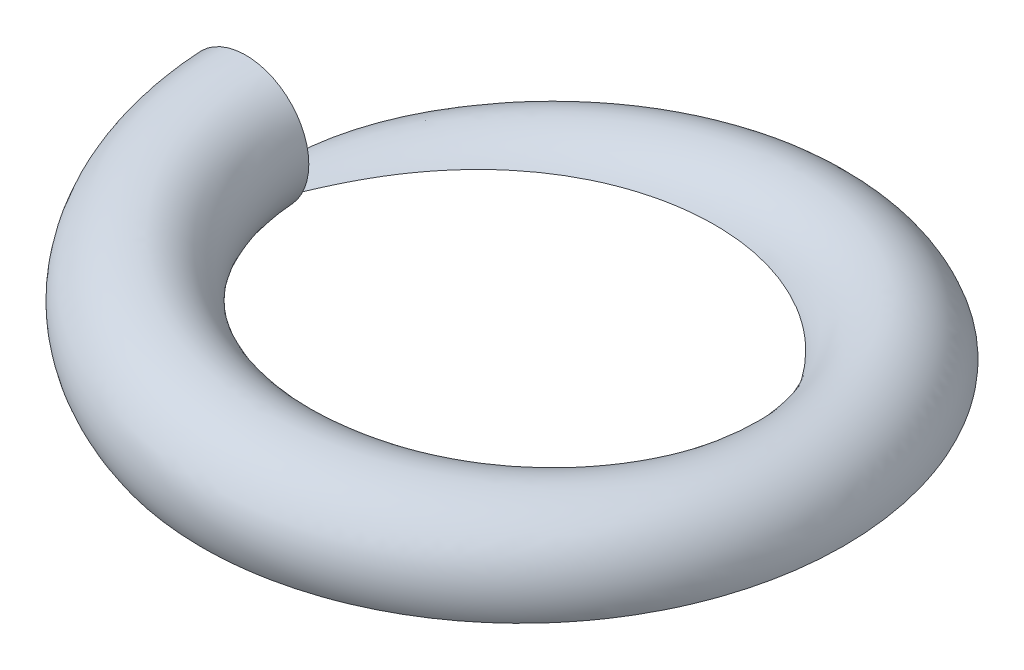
ISO-10303-21;
HEADER;
FILE_DESCRIPTION(('STEP AP214'),'2;1');
FILE_NAME('part.step','',(''),(''),'','','');
FILE_SCHEMA(('AUTOMOTIVE_DESIGN { 1 0 10303 214 1 1 1 1 }'));
ENDSEC;
DATA;
#1=APPLICATION_CONTEXT('core data for automotive mechanical design processes');
#2=APPLICATION_PROTOCOL_DEFINITION('international standard','automotive_design',2000,#1);
#3=PRODUCT_CONTEXT('',#1,'mechanical');
#4=PRODUCT('Part','Part','',(#3));
#5=PRODUCT_RELATED_PRODUCT_CATEGORY('part','',(#4));
#6=PRODUCT_DEFINITION_FORMATION('','',#4);
#7=PRODUCT_DEFINITION_CONTEXT('part definition',#1,'design');
#8=PRODUCT_DEFINITION('design','',#6,#7);
#9=PRODUCT_DEFINITION_SHAPE('','',#8);
#10=(LENGTH_UNIT() NAMED_UNIT(*) SI_UNIT(.MILLI.,.METRE.));
#11=(NAMED_UNIT(*) PLANE_ANGLE_UNIT() SI_UNIT($,.RADIAN.));
#12=(NAMED_UNIT(*) SI_UNIT($,.STERADIAN.) SOLID_ANGLE_UNIT());
#13=UNCERTAINTY_MEASURE_WITH_UNIT(LENGTH_MEASURE(1.E-05),#10,'distance_accuracy_value','');
#14=(GEOMETRIC_REPRESENTATION_CONTEXT(3) GLOBAL_UNCERTAINTY_ASSIGNED_CONTEXT((#13)) GLOBAL_UNIT_ASSIGNED_CONTEXT((#10,
#11,#12)) REPRESENTATION_CONTEXT('',''));
#15=CARTESIAN_POINT('',(0.,0.,0.));
#16=DIRECTION('',(0.,0.,1.));
#17=DIRECTION('',(1.,0.,0.));
#18=AXIS2_PLACEMENT_3D('',#15,#16,#17);
#19=CARTESIAN_POINT('',(-17.,4.,0.));
#20=DIRECTION('',(0.,0.,1.));
#21=DIRECTION('',(1.,0.,0.));
#22=AXIS2_PLACEMENT_3D('',#19,#20,#21);
#23=PLANE('',#22);
#24=CARTESIAN_POINT('',(-17.,4.,0.));
#25=DIRECTION('',(0.,0.,1.));
#26=DIRECTION('',(1.,0.,0.));
#27=AXIS2_PLACEMENT_3D('',#24,#25,#26);
#28=CIRCLE('',#27,4.);
#29=CARTESIAN_POINT('',(-13.,4.,0.));
#30=VERTEX_POINT('',#29);
#31=CARTESIAN_POINT('',(-17.,0.,0.));
#32=VERTEX_POINT('',#31);
#33=EDGE_CURVE('E11',#30,#32,#28,.T.);
#34=ORIENTED_EDGE('',*,*,#33,.F.);
#35=EDGE_CURVE('E44',#32,#30,#28,.T.);
#36=ORIENTED_EDGE('',*,*,#35,.F.);
#37=EDGE_LOOP('',(#34,#36));
#38=FACE_BOUND('',#37,.T.);
#39=ADVANCED_FACE('F33',(#38),#23,.F.);
#40=CARTESIAN_POINT('',(-13.,4.,0.));
#41=CARTESIAN_POINT('',(-13.,3.499375,5.38477631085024));
#42=CARTESIAN_POINT('',(-9.19238815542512,2.99875,9.19238815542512));
#43=CARTESIAN_POINT('',(-5.38477631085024,2.498125,13.));
#44=CARTESIAN_POINT('',(0.,1.9975,13.));
#45=CARTESIAN_POINT('',(5.38477631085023,1.49687500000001,13.));
#46=CARTESIAN_POINT('',(9.19238815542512,0.996250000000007,9.19238815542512));
#47=CARTESIAN_POINT('',(13.,0.495625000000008,5.38477631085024));
#48=CARTESIAN_POINT('',(13.,-0.00499999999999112,0.));
#49=CARTESIAN_POINT('',(13.,-0.50562499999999,-5.38477631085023));
#50=CARTESIAN_POINT('',(9.19238815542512,-1.00624999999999,-9.19238815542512));
#51=CARTESIAN_POINT('',(5.38477631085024,-1.50687499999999,-13.));
#52=CARTESIAN_POINT('',(0.,-2.00749999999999,-13.));
#53=CARTESIAN_POINT('',(-5.38477631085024,-2.50812499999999,-13.));
#54=CARTESIAN_POINT('',(-9.19238815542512,-3.00874999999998,-9.19238815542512));
#55=CARTESIAN_POINT('',(-13.,-3.50937499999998,-5.38477631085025));
#56=CARTESIAN_POINT('',(-13.,-4.00999999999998,0.));
#57=CARTESIAN_POINT('',(-13.,12.,0.));
#58=CARTESIAN_POINT('',(-13.,11.499375,5.38477631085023));
#59=CARTESIAN_POINT('',(-9.19238815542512,10.99875,9.19238815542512));
#60=CARTESIAN_POINT('',(-5.38477631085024,10.498125,13.));
#61=CARTESIAN_POINT('',(0.,9.9975,13.));
#62=CARTESIAN_POINT('',(5.38477631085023,9.49687500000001,13.));
#63=CARTESIAN_POINT('',(9.19238815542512,8.99625000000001,9.19238815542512));
#64=CARTESIAN_POINT('',(13.,8.49562500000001,5.38477631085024));
#65=CARTESIAN_POINT('',(13.,7.99500000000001,0.));
#66=CARTESIAN_POINT('',(13.,7.49437500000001,-5.38477631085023));
#67=CARTESIAN_POINT('',(9.19238815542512,6.99375000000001,-9.19238815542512));
#68=CARTESIAN_POINT('',(5.38477631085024,6.49312500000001,-13.));
#69=CARTESIAN_POINT('',(0.,5.99250000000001,-13.));
#70=CARTESIAN_POINT('',(-5.38477631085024,5.49187500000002,-13.));
#71=CARTESIAN_POINT('',(-9.19238815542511,4.99125000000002,-9.19238815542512));
#72=CARTESIAN_POINT('',(-13.,4.49062500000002,-5.38477631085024));
#73=CARTESIAN_POINT('',(-13.,3.99000000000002,0.));
#74=CARTESIAN_POINT('',(-21.,12.,0.));
#75=CARTESIAN_POINT('',(-21.,11.499375,8.698484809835));
#76=CARTESIAN_POINT('',(-14.8492424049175,10.99875,14.8492424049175));
#77=CARTESIAN_POINT('',(-8.698484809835,10.498125,21.));
#78=CARTESIAN_POINT('',(0.,9.9975,21.));
#79=CARTESIAN_POINT('',(8.698484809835,9.49687500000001,21.));
#80=CARTESIAN_POINT('',(14.8492424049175,8.99625000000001,14.8492424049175));
#81=CARTESIAN_POINT('',(21.,8.49562500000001,8.698484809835));
#82=CARTESIAN_POINT('',(21.,7.99500000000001,0.));
#83=CARTESIAN_POINT('',(21.,7.49437500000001,-8.69848480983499));
#84=CARTESIAN_POINT('',(14.8492424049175,6.99375000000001,-14.8492424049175));
#85=CARTESIAN_POINT('',(8.69848480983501,6.49312500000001,-21.));
#86=CARTESIAN_POINT('',(0.,5.99250000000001,-21.));
#87=CARTESIAN_POINT('',(-8.698484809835,5.49187500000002,-21.));
#88=CARTESIAN_POINT('',(-14.8492424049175,4.99125000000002,-14.8492424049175));
#89=CARTESIAN_POINT('',(-21.,4.49062500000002,-8.69848480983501));
#90=CARTESIAN_POINT('',(-21.,3.99000000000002,0.));
#91=CARTESIAN_POINT('',(-21.,4.,0.));
#92=CARTESIAN_POINT('',(-21.,3.499375,8.698484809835));
#93=CARTESIAN_POINT('',(-14.8492424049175,2.99875,14.8492424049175));
#94=CARTESIAN_POINT('',(-8.698484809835,2.498125,21.));
#95=CARTESIAN_POINT('',(0.,1.99750000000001,21.));
#96=CARTESIAN_POINT('',(8.698484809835,1.49687500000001,21.));
#97=CARTESIAN_POINT('',(14.8492424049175,0.996250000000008,14.8492424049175));
#98=CARTESIAN_POINT('',(21.,0.495625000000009,8.698484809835));
#99=CARTESIAN_POINT('',(21.,-0.00499999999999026,0.));
#100=CARTESIAN_POINT('',(21.,-0.50562499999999,-8.69848480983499));
#101=CARTESIAN_POINT('',(14.8492424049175,-1.00624999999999,-14.8492424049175));
#102=CARTESIAN_POINT('',(8.69848480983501,-1.50687499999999,-21.));
#103=CARTESIAN_POINT('',(0.,-2.00749999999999,-21.));
#104=CARTESIAN_POINT('',(-8.698484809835,-2.50812499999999,-21.));
#105=CARTESIAN_POINT('',(-14.8492424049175,-3.00874999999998,-14.8492424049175));
#106=CARTESIAN_POINT('',(-21.,-3.50937499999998,-8.69848480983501));
#107=CARTESIAN_POINT('',(-21.,-4.00999999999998,0.));
#108=CARTESIAN_POINT('',(-21.,-4.,0.));
#109=CARTESIAN_POINT('',(-21.,-4.500625,8.698484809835));
#110=CARTESIAN_POINT('',(-14.8492424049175,-5.00125,14.8492424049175));
#111=CARTESIAN_POINT('',(-8.698484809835,-5.501875,21.));
#112=CARTESIAN_POINT('',(0.,-6.0025,21.));
#113=CARTESIAN_POINT('',(8.698484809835,-6.503125,21.));
#114=CARTESIAN_POINT('',(14.8492424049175,-7.00374999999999,14.8492424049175));
#115=CARTESIAN_POINT('',(21.,-7.50437499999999,8.698484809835));
#116=CARTESIAN_POINT('',(21.,-8.00499999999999,0.));
#117=CARTESIAN_POINT('',(21.,-8.50562499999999,-8.69848480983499));
#118=CARTESIAN_POINT('',(14.8492424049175,-9.00624999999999,-14.8492424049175));
#119=CARTESIAN_POINT('',(8.69848480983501,-9.50687499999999,-21.));
#120=CARTESIAN_POINT('',(0.,-10.0075,-21.));
#121=CARTESIAN_POINT('',(-8.698484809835,-10.508125,-21.));
#122=CARTESIAN_POINT('',(-14.8492424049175,-11.00875,-14.8492424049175));
#123=CARTESIAN_POINT('',(-21.,-11.509375,-8.69848480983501));
#124=CARTESIAN_POINT('',(-21.,-12.01,0.));
#125=CARTESIAN_POINT('',(-13.,-4.,0.));
#126=CARTESIAN_POINT('',(-13.,-4.500625,5.38477631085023));
#127=CARTESIAN_POINT('',(-9.19238815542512,-5.00125,9.19238815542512));
#128=CARTESIAN_POINT('',(-5.38477631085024,-5.501875,13.));
#129=CARTESIAN_POINT('',(0.,-6.0025,13.));
#130=CARTESIAN_POINT('',(5.38477631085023,-6.503125,13.));
#131=CARTESIAN_POINT('',(9.19238815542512,-7.00374999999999,9.19238815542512));
#132=CARTESIAN_POINT('',(13.,-7.50437499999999,5.38477631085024));
#133=CARTESIAN_POINT('',(13.,-8.00499999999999,0.));
#134=CARTESIAN_POINT('',(13.,-8.50562499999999,-5.38477631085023));
#135=CARTESIAN_POINT('',(9.19238815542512,-9.00624999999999,-9.19238815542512));
#136=CARTESIAN_POINT('',(5.38477631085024,-9.50687499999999,-13.));
#137=CARTESIAN_POINT('',(0.,-10.0075,-13.));
#138=CARTESIAN_POINT('',(-5.38477631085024,-10.508125,-13.));
#139=CARTESIAN_POINT('',(-9.19238815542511,-11.00875,-9.19238815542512));
#140=CARTESIAN_POINT('',(-13.,-11.509375,-5.38477631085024));
#141=CARTESIAN_POINT('',(-13.,-12.01,0.));
#142=CARTESIAN_POINT('',(-13.,4.,0.));
#143=CARTESIAN_POINT('',(-13.,3.499375,5.38477631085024));
#144=CARTESIAN_POINT('',(-9.19238815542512,2.99875,9.19238815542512));
#145=CARTESIAN_POINT('',(-5.38477631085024,2.498125,13.));
#146=CARTESIAN_POINT('',(0.,1.9975,13.));
#147=CARTESIAN_POINT('',(5.38477631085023,1.49687500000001,13.));
#148=CARTESIAN_POINT('',(9.19238815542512,0.996250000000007,9.19238815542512));
#149=CARTESIAN_POINT('',(13.,0.495625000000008,5.38477631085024));
#150=CARTESIAN_POINT('',(13.,-0.00499999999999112,0.));
#151=CARTESIAN_POINT('',(13.,-0.50562499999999,-5.38477631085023));
#152=CARTESIAN_POINT('',(9.19238815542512,-1.00624999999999,-9.19238815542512));
#153=CARTESIAN_POINT('',(5.38477631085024,-1.50687499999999,-13.));
#154=CARTESIAN_POINT('',(0.,-2.00749999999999,-13.));
#155=CARTESIAN_POINT('',(-5.38477631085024,-2.50812499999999,-13.));
#156=CARTESIAN_POINT('',(-9.19238815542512,-3.00874999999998,-9.19238815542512));
#157=CARTESIAN_POINT('',(-13.,-3.50937499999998,-5.38477631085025));
#158=CARTESIAN_POINT('',(-13.,-4.00999999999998,0.));
#159=(BOUNDED_SURFACE() B_SPLINE_SURFACE(3,2,((#40,#41,#42,#43,#44,#45,#46,#47,#48,#49,#50,#51,
#52,#53,#54,#55,#56),(#57,#58,#59,#60,#61,#62,#63,#64,#65,#66,#67,#68,#69,#70,#71,#72,#73),(#74,
#75,#76,#77,#78,#79,#80,#81,#82,#83,#84,#85,#86,#87,#88,#89,#90),(#91,#92,#93,#94,#95,#96,#97,
#98,#99,#100,#101,#102,#103,#104,#105,#106,#107),(#108,#109,#110,#111,#112,#113,#114,#115,#116,
#117,#118,#119,#120,#121,#122,#123,#124),(#125,#126,#127,#128,#129,#130,#131,#132,#133,#134,
#135,#136,#137,#138,#139,#140,#141),(#142,#143,#144,#145,#146,#147,#148,#149,#150,#151,#152,
#153,#154,#155,#156,#157,#158)),.UNSPECIFIED.,.T.,.F.,.F.) B_SPLINE_SURFACE_WITH_KNOTS((4,3,4),
(3,2,2,2,2,2,2,2,3),(0.,0.5,1.),(0.,0.125,0.25,0.375,0.5,0.625,0.75,0.875,1.),
.UNSPECIFIED.) GEOMETRIC_REPRESENTATION_ITEM() RATIONAL_B_SPLINE_SURFACE(((1.,0.923879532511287,
1.,0.923879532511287,1.,0.923879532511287,1.,0.923879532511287,1.,0.923879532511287,1.,
0.923879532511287,1.,0.923879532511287,1.,0.923879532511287,1.),(0.333333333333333,
0.307959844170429,0.333333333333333,0.307959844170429,0.333333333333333,0.307959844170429,
0.333333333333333,0.307959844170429,0.333333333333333,0.307959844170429,0.333333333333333,
0.307959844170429,0.333333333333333,0.307959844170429,0.333333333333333,0.307959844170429,
0.333333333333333),(0.333333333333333,0.307959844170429,0.333333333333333,0.307959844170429,
0.333333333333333,0.307959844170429,0.333333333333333,0.307959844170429,0.333333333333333,
0.307959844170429,0.333333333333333,0.307959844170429,0.333333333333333,0.307959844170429,
0.333333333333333,0.307959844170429,0.333333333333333),(1.,0.923879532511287,1.,
0.923879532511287,1.,0.923879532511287,1.,0.923879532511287,1.,0.923879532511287,1.,
0.923879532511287,1.,0.923879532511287,1.,0.923879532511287,1.),(0.333333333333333,
0.307959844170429,0.333333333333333,0.307959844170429,0.333333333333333,0.307959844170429,
0.333333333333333,0.307959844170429,0.333333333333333,0.307959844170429,0.333333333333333,
0.307959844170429,0.333333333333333,0.307959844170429,0.333333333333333,0.307959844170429,
0.333333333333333),(0.333333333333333,0.307959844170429,0.333333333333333,0.307959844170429,
0.333333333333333,0.307959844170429,0.333333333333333,0.307959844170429,0.333333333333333,
0.307959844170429,0.333333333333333,0.307959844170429,0.333333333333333,0.307959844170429,
0.333333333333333,0.307959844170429,0.333333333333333),(1.,0.923879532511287,1.,
0.923879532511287,1.,0.923879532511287,1.,0.923879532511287,1.,0.923879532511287,1.,
0.923879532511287,1.,0.923879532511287,1.,0.923879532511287,1.))) REPRESENTATION_ITEM('') SURFACE());
#160=CARTESIAN_POINT('',(-17.,0.,0.));
#161=CARTESIAN_POINT('',(-16.9821654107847,0.,-1.0936756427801E-06));
#162=CARTESIAN_POINT('',(-16.964333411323,0.,0.00169738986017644));
#163=CARTESIAN_POINT('',(-16.929235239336,0.,0.00822917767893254));
#164=CARTESIAN_POINT('',(-16.9119704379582,0.,0.0130695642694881));
#165=CARTESIAN_POINT('',(-16.8504324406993,0.,0.0355143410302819));
#166=CARTESIAN_POINT('',(-16.8090736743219,0.,0.0609497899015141));
#167=CARTESIAN_POINT('',(-16.7490549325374,0.,0.107908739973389));
#168=CARTESIAN_POINT('',(-16.7279790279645,0.,0.126855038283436));
#169=CARTESIAN_POINT('',(-16.6877210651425,0.,0.16668707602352));
#170=CARTESIAN_POINT('',(-16.668537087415,0.,0.187570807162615));
#171=CARTESIAN_POINT('',(-16.6315826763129,0.,0.230761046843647));
#172=CARTESIAN_POINT('',(-16.6138228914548,0.,0.253076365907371));
#173=CARTESIAN_POINT('',(-16.5795232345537,0.,0.298619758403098));
#174=CARTESIAN_POINT('',(-16.5629832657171,0.,0.321847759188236));
#175=CARTESIAN_POINT('',(-16.5239391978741,0.,0.379145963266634));
#176=CARTESIAN_POINT('',(-16.5019473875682,0.,0.41356283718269));
#177=CARTESIAN_POINT('',(-16.4594436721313,0.,0.483303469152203));
#178=CARTESIAN_POINT('',(-16.4389322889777,0.,0.51862754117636));
#179=CARTESIAN_POINT('',(-16.3789942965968,0.,0.625665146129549));
#180=CARTESIAN_POINT('',(-16.3412474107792,0.,0.698314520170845));
#181=CARTESIAN_POINT('',(-16.2683895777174,0.,0.844995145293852));
#182=CARTESIAN_POINT('',(-16.2332817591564,0.,0.919027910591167));
#183=CARTESIAN_POINT('',(-16.1646686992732,0.,1.06801292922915));
#184=CARTESIAN_POINT('',(-16.1311668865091,0.,1.14296675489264));
#185=CARTESIAN_POINT('',(-16.0652349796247,0.,1.29320499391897));
#186=CARTESIAN_POINT('',(-16.0328033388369,0.,1.36848873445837));
#187=CARTESIAN_POINT('',(-15.9685374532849,0.,1.51926894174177));
#188=CARTESIAN_POINT('',(-15.9367029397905,0.,1.59476529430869));
#189=CARTESIAN_POINT('',(-15.8419339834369,0.,1.82058054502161));
#190=CARTESIAN_POINT('',(-15.7793783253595,0.,1.97105762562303));
#191=CARTESIAN_POINT('',(-15.6536733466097,0.,2.27176481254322));
#192=CARTESIAN_POINT('',(-15.5905240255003,0.,2.42199491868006));
#193=CARTESIAN_POINT('',(-15.4626643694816,0.,2.7218603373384));
#194=CARTESIAN_POINT('',(-15.3979534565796,0.,2.87149540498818));
#195=CARTESIAN_POINT('',(-15.2663719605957,0.,3.16981206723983));
#196=CARTESIAN_POINT('',(-15.1995013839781,0.,3.31849366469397));
#197=CARTESIAN_POINT('',(-14.9949746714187,0.,3.76274859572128));
#198=CARTESIAN_POINT('',(-14.8533996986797,0.,4.05654127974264));
#199=CARTESIAN_POINT('',(-14.5581878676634,0.,4.63685001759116));
#200=CARTESIAN_POINT('',(-14.4045908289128,0.,4.92338625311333));
#201=CARTESIAN_POINT('',(-14.083845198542,0.,5.48893966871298));
#202=CARTESIAN_POINT('',(-13.9166918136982,0.,5.7679541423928));
#203=CARTESIAN_POINT('',(-13.568392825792,0.,6.31710038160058));
#204=CARTESIAN_POINT('',(-13.3872468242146,0.,6.58723189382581));
#205=CARTESIAN_POINT('',(-12.91231293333,0.,7.25609637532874));
#206=CARTESIAN_POINT('',(-12.6091299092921,0.,7.64826346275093));
#207=CARTESIAN_POINT('',(-12.1301696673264,0.,8.21592444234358));
#208=CARTESIAN_POINT('',(-11.9664612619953,0.,8.40173716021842));
#209=CARTESIAN_POINT('',(-11.6311035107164,0.,8.76608144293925));
#210=CARTESIAN_POINT('',(-11.4594541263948,0.,8.94461297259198));
#211=CARTESIAN_POINT('',(-11.1082106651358,0.,9.29412360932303));
#212=CARTESIAN_POINT('',(-10.9286073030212,0.,9.46509339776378));
#213=CARTESIAN_POINT('',(-10.6535904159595,0.,9.71535462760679));
#214=CARTESIAN_POINT('',(-10.5609799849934,0.,9.79774514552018));
#215=CARTESIAN_POINT('',(-10.3739214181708,0.,9.96041829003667));
#216=CARTESIAN_POINT('',(-10.2794732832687,0.,10.0407009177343));
#217=CARTESIAN_POINT('',(-10.1364471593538,0.,10.1594761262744));
#218=CARTESIAN_POINT('',(-10.0885494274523,0.,10.1987904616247));
#219=CARTESIAN_POINT('',(-9.99226295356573,0.,10.2768130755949));
#220=CARTESIAN_POINT('',(-9.94387421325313,0.,10.3155213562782));
#221=CARTESIAN_POINT('',(-9.79799655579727,0.,10.4307438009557));
#222=CARTESIAN_POINT('',(-9.69979401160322,0.,10.5063573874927));
#223=CARTESIAN_POINT('',(-9.50154554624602,0.,10.6551206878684));
#224=CARTESIAN_POINT('',(-9.4014996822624,0.,10.7282704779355));
#225=CARTESIAN_POINT('',(-9.19962512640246,0.,10.8720639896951));
#226=CARTESIAN_POINT('',(-9.09779642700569,0.,10.9427077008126));
#227=CARTESIAN_POINT('',(-8.80117963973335,0.,11.1430736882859));
#228=CARTESIAN_POINT('',(-8.60416973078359,0.,11.2695296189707));
#229=CARTESIAN_POINT('',(-8.20443501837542,0.,11.513045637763));
#230=CARTESIAN_POINT('',(-8.00171014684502,0.,11.6301056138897));
#231=CARTESIAN_POINT('',(-7.59093912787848,0.,11.8545777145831));
#232=CARTESIAN_POINT('',(-7.38289219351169,0.,11.9619884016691));
#233=CARTESIAN_POINT('',(-6.96198719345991,0.,12.1668734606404));
#234=CARTESIAN_POINT('',(-6.74912917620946,0.,12.2643479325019));
#235=CARTESIAN_POINT('',(-6.10406480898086,0.,12.5414783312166));
#236=CARTESIAN_POINT('',(-5.66520180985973,0.,12.7059321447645));
#237=CARTESIAN_POINT('',(-4.77400007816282,0.,12.9924085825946));
#238=CARTESIAN_POINT('',(-4.3216637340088,0.,13.1144386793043));
#239=CARTESIAN_POINT('',(-3.45624979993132,0.,13.3040829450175));
#240=CARTESIAN_POINT('',(-3.04414488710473,0.,13.3761198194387));
#241=CARTESIAN_POINT('',(-2.42259936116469,0.,13.4574807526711));
#242=CARTESIAN_POINT('',(-2.21482865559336,0.,13.4801530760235));
#243=CARTESIAN_POINT('',(-1.7984873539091,0.,13.5165393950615));
#244=CARTESIAN_POINT('',(-1.58991674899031,0.,13.5302532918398));
#245=CARTESIAN_POINT('',(-1.17252957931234,0.,13.5486593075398));
#246=CARTESIAN_POINT('',(-0.963713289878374,0.,13.5533577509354));
#247=CARTESIAN_POINT('',(-0.546064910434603,0.,13.55371311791));
#248=CARTESIAN_POINT('',(-0.337232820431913,0.,13.5493700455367));
#249=CARTESIAN_POINT('',(-0.0242953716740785,0.,13.5360653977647));
#250=CARTESIAN_POINT('',(0.0799639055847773,0.,13.5304989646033));
#251=CARTESIAN_POINT('',(0.288327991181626,0.,13.5169874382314));
#252=CARTESIAN_POINT('',(0.392432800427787,0.,13.509042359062));
#253=CARTESIAN_POINT('',(0.704430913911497,0.,13.4816721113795));
#254=CARTESIAN_POINT('',(0.912024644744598,0.,13.4587112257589));
#255=CARTESIAN_POINT('',(1.31976594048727,0.,13.4042322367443));
#256=CARTESIAN_POINT('',(1.51995058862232,0.,13.3729904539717));
#257=CARTESIAN_POINT('',(1.91874457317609,0.,13.3017513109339));
#258=CARTESIAN_POINT('',(2.11735389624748,0.,13.2617538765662));
#259=CARTESIAN_POINT('',(2.71027079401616,0.,13.1287331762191));
#260=CARTESIAN_POINT('',(3.10173915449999,0.,13.0226718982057));
#261=CARTESIAN_POINT('',(3.87389126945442,0.,12.7766362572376));
#262=CARTESIAN_POINT('',(4.25457285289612,0.,12.6366551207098));
#263=CARTESIAN_POINT('',(5.00218825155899,0.,12.3238496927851));
#264=CARTESIAN_POINT('',(5.36912294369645,0.,12.1510275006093));
#265=CARTESIAN_POINT('',(6.07226091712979,0.,11.7812670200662));
#266=CARTESIAN_POINT('',(6.4091053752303,0.,11.5855466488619));
#267=CARTESIAN_POINT('',(7.06504363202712,0.,11.1663415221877));
#268=CARTESIAN_POINT('',(7.38413736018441,0.,10.9428566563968));
#269=CARTESIAN_POINT('',(8.00219031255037,0.,10.4696812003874));
#270=CARTESIAN_POINT('',(8.30115537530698,0.,10.2199982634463));
#271=CARTESIAN_POINT('',(8.73278741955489,0.,9.82716789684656));
#272=CARTESIAN_POINT('',(8.87387468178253,0.,9.69315995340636));
#273=CARTESIAN_POINT('',(9.15024148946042,0.,9.41926065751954));
#274=CARTESIAN_POINT('',(9.28552099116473,0.,9.27936926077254));
#275=CARTESIAN_POINT('',(9.54907919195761,0.,8.99468476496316));
#276=CARTESIAN_POINT('',(9.67739474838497,0.,8.84992577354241));
#277=CARTESIAN_POINT('',(9.92764293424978,0.,8.55500917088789));
#278=CARTESIAN_POINT('',(10.0495759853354,0.,8.4048519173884));
#279=CARTESIAN_POINT('',(10.2868404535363,0.,8.09942649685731));
#280=CARTESIAN_POINT('',(10.402172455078,0.,7.94415878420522));
#281=CARTESIAN_POINT('',(10.6260599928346,0.,7.62876698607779));
#282=CARTESIAN_POINT('',(10.734613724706,0.,7.4686416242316));
#283=CARTESIAN_POINT('',(11.0497415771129,0.,6.98151295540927));
#284=CARTESIAN_POINT('',(11.2458615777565,0.,6.64765504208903));
#285=CARTESIAN_POINT('',(11.608645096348,0.,5.96435455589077));
#286=CARTESIAN_POINT('',(11.7753082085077,0.,5.61491176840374));
#287=CARTESIAN_POINT('',(12.0746927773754,0.,4.91074074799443));
#288=CARTESIAN_POINT('',(12.208074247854,0.,4.55629326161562));
#289=CARTESIAN_POINT('',(12.4445457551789,0.,3.83744127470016));
#290=CARTESIAN_POINT('',(12.5476363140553,0.,3.47303694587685));
#291=CARTESIAN_POINT('',(12.7227525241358,0.,2.73688432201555));
#292=CARTESIAN_POINT('',(12.7947819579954,0.,2.36513692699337));
#293=CARTESIAN_POINT('',(12.9072267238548,0.,1.61689217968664));
#294=CARTESIAN_POINT('',(12.9476422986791,0.,1.24039486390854));
#295=CARTESIAN_POINT('',(12.9964840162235,0.,0.485304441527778));
#296=CARTESIAN_POINT('',(13.00490815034,0.,0.106711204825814));
#297=CARTESIAN_POINT('',(12.9896490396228,0.,-0.649828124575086));
#298=CARTESIAN_POINT('',(12.9659656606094,0.,-1.02777421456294));
#299=CARTESIAN_POINT('',(12.8867640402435,0.,-1.78036007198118));
#300=CARTESIAN_POINT('',(12.8312418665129,0.,-2.15499942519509));
#301=CARTESIAN_POINT('',(12.6888198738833,0.,-2.89825779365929));
#302=CARTESIAN_POINT('',(12.6019205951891,0.,-3.2668769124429));
#303=CARTESIAN_POINT('',(12.3976893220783,0.,-3.99449796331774));
#304=CARTESIAN_POINT('',(12.2804410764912,0.,-4.35352340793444));
#305=CARTESIAN_POINT('',(12.0162505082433,0.,-5.06047894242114));
#306=CARTESIAN_POINT('',(11.8693080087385,0.,-5.40840896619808));
#307=CARTESIAN_POINT('',(11.5467966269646,0.,-6.09065536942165));
#308=CARTESIAN_POINT('',(11.3712336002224,0.,-6.42497451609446));
#309=CARTESIAN_POINT('',(10.9926949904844,0.,-7.07769269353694));
#310=CARTESIAN_POINT('',(10.789719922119,0.,-7.39609202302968));
#311=CARTESIAN_POINT('',(10.3568308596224,0.,-8.01600123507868));
#312=CARTESIAN_POINT('',(10.1268113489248,0.,-8.31743769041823));
#313=CARTESIAN_POINT('',(9.76336975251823,0.,-8.75414737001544));
#314=CARTESIAN_POINT('',(9.63913819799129,0.,-8.89715894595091));
#315=CARTESIAN_POINT('',(9.38471505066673,0.,-9.17777933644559));
#316=CARTESIAN_POINT('',(9.25452341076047,0.,-9.31538810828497));
#317=CARTESIAN_POINT('',(8.85548555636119,0.,-9.7199927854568));
#318=CARTESIAN_POINT('',(8.57819194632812,0.,-9.9787484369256));
#319=CARTESIAN_POINT('',(8.00319994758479,0.,-10.4724272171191));
#320=CARTESIAN_POINT('',(7.70550118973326,0.,-10.7073499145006));
#321=CARTESIAN_POINT('',(7.08924917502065,0.,-11.1536870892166));
#322=CARTESIAN_POINT('',(6.77054577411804,0.,-11.3648944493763));
#323=CARTESIAN_POINT('',(6.11674451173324,0.,-11.7601654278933));
#324=CARTESIAN_POINT('',(5.78164693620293,0.,-11.9442295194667));
#325=CARTESIAN_POINT('',(5.09748755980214,0.,-12.2839498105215));
#326=CARTESIAN_POINT('',(4.74843057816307,0.,-12.4396157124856));
#327=CARTESIAN_POINT('',(4.03865157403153,0.,-12.7215828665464));
#328=CARTESIAN_POINT('',(3.67792906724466,0.,-12.8478828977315));
#329=CARTESIAN_POINT('',(2.94073137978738,0.,-13.0722440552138));
#330=CARTESIAN_POINT('',(2.56409015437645,0.,-13.1697632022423));
#331=CARTESIAN_POINT('',(1.99409457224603,0.,-13.2920080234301));
#332=CARTESIAN_POINT('',(1.80324124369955,0.,-13.3287526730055));
#333=CARTESIAN_POINT('',(1.42014762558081,0.,-13.3941750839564));
#334=CARTESIAN_POINT('',(1.22790735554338,0.,-13.4228529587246));
#335=CARTESIAN_POINT('',(0.842315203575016,0.,-13.4720867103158));
#336=CARTESIAN_POINT('',(0.648962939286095,0.,-13.4926396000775));
#337=CARTESIAN_POINT('',(0.358423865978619,0.,-13.5173404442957));
#338=CARTESIAN_POINT('',(0.26148934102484,0.,-13.5245527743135));
#339=CARTESIAN_POINT('',(0.0674888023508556,0.,-13.5369175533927));
#340=CARTESIAN_POINT('',(-0.0295772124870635,0.,-13.5420699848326));
#341=CARTESIAN_POINT('',(-0.320915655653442,0.,-13.5545888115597));
#342=CARTESIAN_POINT('',(-0.51532360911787,0.,-13.5590163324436));
#343=CARTESIAN_POINT('',(-0.904142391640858,0.,-13.5600394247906));
#344=CARTESIAN_POINT('',(-1.09855322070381,0.,-13.5566349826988));
#345=CARTESIAN_POINT('',(-1.68555879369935,0.,-13.5345548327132));
#346=CARTESIAN_POINT('',(-2.07777193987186,0.,-13.503833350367));
#347=CARTESIAN_POINT('',(-2.85835934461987,0.,-13.4108767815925));
#348=CARTESIAN_POINT('',(-3.24673388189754,0.,-13.3486440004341));
#349=CARTESIAN_POINT('',(-4.01720918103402,0.,-13.1932509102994));
#350=CARTESIAN_POINT('',(-4.39931065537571,0.,-13.1000941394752));
#351=CARTESIAN_POINT('',(-5.15488844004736,0.,-12.8835946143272));
#352=CARTESIAN_POINT('',(-5.52836404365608,0.,-12.7602493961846));
#353=CARTESIAN_POINT('',(-6.28266367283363,0.,-12.4774278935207));
#354=CARTESIAN_POINT('',(-6.66292802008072,0.,-12.316458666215));
#355=CARTESIAN_POINT('',(-7.40881106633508,0.,-11.9634980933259));
#356=CARTESIAN_POINT('',(-7.77443024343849,0.,-11.7715077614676));
#357=CARTESIAN_POINT('',(-8.30994155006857,0.,-11.4613944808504));
#358=CARTESIAN_POINT('',(-8.48631839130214,0.,-11.3543173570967));
#359=CARTESIAN_POINT('',(-8.83450568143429,0.,-11.1329643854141));
#360=CARTESIAN_POINT('',(-9.0063162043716,0.,-11.0186886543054));
#361=CARTESIAN_POINT('',(-9.34507730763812,0.,-10.7831364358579));
#362=CARTESIAN_POINT('',(-9.51202779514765,0.,-10.6618598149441));
#363=CARTESIAN_POINT('',(-9.75859764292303,0.,-10.4748789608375));
#364=CARTESIAN_POINT('',(-9.84014739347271,0.,-10.4117056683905));
#365=CARTESIAN_POINT('',(-10.0019139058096,0.,-10.2836721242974));
#366=CARTESIAN_POINT('',(-10.0821306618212,0.,-10.2188118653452));
#367=CARTESIAN_POINT('',(-10.2423576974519,0.,-10.086628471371));
#368=CARTESIAN_POINT('',(-10.3223501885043,0.,-10.0192837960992));
#369=CARTESIAN_POINT('',(-10.4810503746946,0.,-9.88309915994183));
#370=CARTESIAN_POINT('',(-10.5597580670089,0.,-9.81425919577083));
#371=CARTESIAN_POINT('',(-10.793898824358,0.,-9.60551446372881));
#372=CARTESIAN_POINT('',(-10.9473547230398,0.,-9.46338060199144));
#373=CARTESIAN_POINT('',(-11.2488451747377,0.,-9.17345866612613));
#374=CARTESIAN_POINT('',(-11.396879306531,0.,-9.02567015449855));
#375=CARTESIAN_POINT('',(-11.6873744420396,0.,-8.72473143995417));
#376=CARTESIAN_POINT('',(-11.8298355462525,0.,-8.57158133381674));
#377=CARTESIAN_POINT('',(-12.2486812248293,0.,-8.10452183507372));
#378=CARTESIAN_POINT('',(-12.5165900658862,0.,-7.78294360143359));
#379=CARTESIAN_POINT('',(-13.0290894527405,0.,-7.12186317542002));
#380=CARTESIAN_POINT('',(-13.2736836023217,0.,-6.78236376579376));
#381=CARTESIAN_POINT('',(-13.6768715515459,0.,-6.18146720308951));
#382=CARTESIAN_POINT('',(-13.840878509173,0.,-5.92367713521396));
#383=CARTESIAN_POINT('',(-14.1568134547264,0.,-5.40084108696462));
#384=CARTESIAN_POINT('',(-14.3087427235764,0.,-5.1357958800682));
#385=CARTESIAN_POINT('',(-14.6010634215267,0.,-4.59971852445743));
#386=CARTESIAN_POINT('',(-14.7414640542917,0.,-4.32869137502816));
#387=CARTESIAN_POINT('',(-15.0120537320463,0.,-3.78160911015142));
#388=CARTESIAN_POINT('',(-15.1422426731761,-1.88056586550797E-13,-3.50555394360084));
#389=CARTESIAN_POINT('',(-15.343095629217,-1.20443326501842E-13,-3.06346838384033));
#390=CARTESIAN_POINT('',(-15.4163360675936,0.,-2.89859478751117));
#391=CARTESIAN_POINT('',(-15.5608861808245,0.,-2.56799950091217));
#392=CARTESIAN_POINT('',(-15.6321957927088,0.,-2.40227778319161));
#393=CARTESIAN_POINT('',(-15.7741420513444,0.,-2.07051260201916));
#394=CARTESIAN_POINT('',(-15.844778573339,0.,-1.90446908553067));
#395=CARTESIAN_POINT('',(-15.9519322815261,0.,-1.65593394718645));
#396=CARTESIAN_POINT('',(-15.9878470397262,0.,-1.57318395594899));
#397=CARTESIAN_POINT('',(-16.0605572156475,0.,-1.40807262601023));
#398=CARTESIAN_POINT('',(-16.0973525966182,0.,-1.32571127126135));
#399=CARTESIAN_POINT('',(-16.1608549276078,0.,-1.18715089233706));
#400=CARTESIAN_POINT('',(-16.1871496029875,0.,-1.13076361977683));
#401=CARTESIAN_POINT('',(-16.2408314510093,0.,-1.01849078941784));
#402=CARTESIAN_POINT('',(-16.2682188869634,0.,-0.962605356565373));
#403=CARTESIAN_POINT('',(-16.324570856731,0.,-0.851593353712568));
#404=CARTESIAN_POINT('',(-16.3535362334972,1.54647755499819E-13,-0.796467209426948));
#405=CARTESIAN_POINT('',(-16.4137297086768,-1.5456733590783E-13,-0.687474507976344));
#406=CARTESIAN_POINT('',(-16.4449566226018,-5.76737349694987E-13,-0.633607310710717));
#407=CARTESIAN_POINT('',(-16.4950082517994,-3.22488806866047E-13,-0.553407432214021));
#408=CARTESIAN_POINT('',(-16.5125744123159,0.,-0.526292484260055));
#409=CARTESIAN_POINT('',(-16.5488870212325,0.,-0.472868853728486));
#410=CARTESIAN_POINT('',(-16.5676331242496,0.,-0.446559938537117));
#411=CARTESIAN_POINT('',(-16.6066557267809,0.,-0.395053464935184));
#412=CARTESIAN_POINT('',(-16.6269335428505,1.38065458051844E-13,-0.369856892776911));
#413=CARTESIAN_POINT('',(-16.6694440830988,-1.37896561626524E-13,-0.321189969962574));
#414=CARTESIAN_POINT('',(-16.6916743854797,-5.36002083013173E-13,-0.297717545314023));
#415=CARTESIAN_POINT('',(-16.739767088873,-5.52365816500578E-13,-0.252428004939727));
#416=CARTESIAN_POINT('',(-16.7657486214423,-1.34370833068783E-13,-0.23073454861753));
#417=CARTESIAN_POINT('',(-16.8211864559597,1.33289062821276E-13,-0.192453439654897));
#418=CARTESIAN_POINT('',(-16.8506130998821,0.,-0.175826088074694));
#419=CARTESIAN_POINT('',(-16.8977197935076,0.,-0.157105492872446));
#420=CARTESIAN_POINT('',(-16.9141378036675,0.,-0.151877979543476));
#421=CARTESIAN_POINT('',(-16.9476171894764,0.,-0.144189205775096));
#422=CARTESIAN_POINT('',(-16.9646779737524,0.,-0.14172546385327));
#423=CARTESIAN_POINT('',(-16.9990517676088,0.,-0.139896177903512));
#424=CARTESIAN_POINT('',(-17.0163655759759,0.,-0.140544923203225));
#425=CARTESIAN_POINT('',(-17.0505992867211,0.,-0.144929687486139));
#426=CARTESIAN_POINT('',(-17.0675188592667,0.,-0.14866820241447));
#427=CARTESIAN_POINT('',(-17.1039768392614,0.,-0.159901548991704));
#428=CARTESIAN_POINT('',(-17.1233196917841,0.,-0.168020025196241));
#429=CARTESIAN_POINT('',(-17.1604853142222,0.,-0.18724942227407));
#430=CARTESIAN_POINT('',(-17.1783025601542,0.,-0.198370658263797));
#431=CARTESIAN_POINT('',(-17.2097572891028,0.,-0.2208659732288));
#432=CARTESIAN_POINT('',(-17.2236161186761,0.,-0.231937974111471));
#433=CARTESIAN_POINT('',(-17.2503010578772,0.,-0.255216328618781));
#434=CARTESIAN_POINT('',(-17.2631286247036,0.,-0.267421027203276));
#435=CARTESIAN_POINT('',(-17.2879240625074,0.,-0.292741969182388));
#436=CARTESIAN_POINT('',(-17.2998890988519,0.,-0.305860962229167));
#437=CARTESIAN_POINT('',(-17.3230238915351,0.,-0.332784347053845));
#438=CARTESIAN_POINT('',(-17.3341933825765,0.,-0.346588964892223));
#439=CARTESIAN_POINT('',(-17.3762047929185,0.,-0.401198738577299));
#440=CARTESIAN_POINT('',(-17.4045260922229,0.,-0.443943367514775));
#441=CARTESIAN_POINT('',(-17.4571010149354,0.,-0.53187244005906));
#442=CARTESIAN_POINT('',(-17.4813465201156,0.,-0.577061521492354));
#443=CARTESIAN_POINT('',(-17.526841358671,0.,-0.669197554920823));
#444=CARTESIAN_POINT('',(-17.548074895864,0.,-0.716152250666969));
#445=CARTESIAN_POINT('',(-17.5880237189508,0.,-0.81105244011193));
#446=CARTESIAN_POINT('',(-17.6067413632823,0.,-0.858996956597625));
#447=CARTESIAN_POINT('',(-17.6532794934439,0.,-0.986081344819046));
#448=CARTESIAN_POINT('',(-17.6794038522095,0.,-1.06584131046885));
#449=CARTESIAN_POINT('',(-17.727421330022,0.,-1.22663857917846));
#450=CARTESIAN_POINT('',(-17.7493123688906,0.,-1.30767648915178));
#451=CARTESIAN_POINT('',(-17.7896079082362,0.,-1.47075608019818));
#452=CARTESIAN_POINT('',(-17.8080063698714,0.,-1.55279924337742));
#453=CARTESIAN_POINT('',(-17.8417571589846,0.,-1.71751384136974));
#454=CARTESIAN_POINT('',(-17.8571090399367,0.,-1.80018536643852));
#455=CARTESIAN_POINT('',(-17.8991399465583,0.,-2.04896112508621));
#456=CARTESIAN_POINT('',(-17.9217773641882,0.,-2.2157552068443));
#457=CARTESIAN_POINT('',(-17.9580225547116,0.,-2.55012320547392));
#458=CARTESIAN_POINT('',(-17.9716385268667,0.,-2.71769627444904));
#459=CARTESIAN_POINT('',(-17.9913303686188,0.,-3.06056324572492));
#460=CARTESIAN_POINT('',(-17.9970541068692,0.,-3.23587718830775));
#461=CARTESIAN_POINT('',(-18.0006268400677,0.,-3.58659373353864));
#462=CARTESIAN_POINT('',(-17.9984744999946,0.,-3.7619963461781));
#463=CARTESIAN_POINT('',(-17.9810480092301,0.,-4.28813189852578));
#464=CARTESIAN_POINT('',(-17.9547918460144,0.,-4.63854250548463));
#465=CARTESIAN_POINT('',(-17.8759637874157,0.,-5.33635761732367));
#466=CARTESIAN_POINT('',(-17.8233865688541,0.,-5.68376149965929));
#467=CARTESIAN_POINT('',(-17.6938262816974,0.,-6.37385347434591));
#468=CARTESIAN_POINT('',(-17.6168500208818,0.,-6.71654285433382));
#469=CARTESIAN_POINT('',(-17.4114485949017,0.,-7.50528945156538));
#470=CARTESIAN_POINT('',(-17.274438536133,0.,-7.94912737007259));
#471=CARTESIAN_POINT('',(-16.9629709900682,0.,-8.8234936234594));
#472=CARTESIAN_POINT('',(-16.7885053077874,0.,-9.25401902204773));
#473=CARTESIAN_POINT('',(-16.4044433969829,0.,-10.0992104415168));
#474=CARTESIAN_POINT('',(-16.1948374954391,0.,-10.5138720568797));
#475=CARTESIAN_POINT('',(-15.7427409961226,0.,-11.3248112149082));
#476=CARTESIAN_POINT('',(-15.5002557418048,0.,-11.7210917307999));
#477=CARTESIAN_POINT('',(-15.1128222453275,0.,-12.3011182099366));
#478=CARTESIAN_POINT('',(-14.9793029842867,0.,-12.4925978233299));
#479=CARTESIAN_POINT('',(-14.7047707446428,0.,-12.8701110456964));
#480=CARTESIAN_POINT('',(-14.5637580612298,0.,-13.0561448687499));
#481=CARTESIAN_POINT('',(-14.274500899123,0.,-13.4225323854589));
#482=CARTESIAN_POINT('',(-14.1262557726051,0.,-13.6028855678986));
#483=CARTESIAN_POINT('',(-13.8986894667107,0.,-13.8689524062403));
#484=CARTESIAN_POINT('',(-13.8219654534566,0.,-13.956899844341));
#485=CARTESIAN_POINT('',(-13.666913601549,0.,-14.131375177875));
#486=CARTESIAN_POINT('',(-13.588585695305,0.,-14.2179030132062));
#487=CARTESIAN_POINT('',(-13.3511988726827,0.,-14.4753082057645));
#488=CARTESIAN_POINT('',(-13.1897485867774,0.,-14.6439935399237));
#489=CARTESIAN_POINT('',(-12.8607320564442,0.,-14.9752857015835));
#490=CARTESIAN_POINT('',(-12.6931654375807,0.,-15.1378921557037));
#491=CARTESIAN_POINT('',(-12.181650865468,0.,-15.6162490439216));
#492=CARTESIAN_POINT('',(-11.8288273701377,0.,-15.9226029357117));
#493=CARTESIAN_POINT('',(-11.0620757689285,0.,-16.5403746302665));
#494=CARTESIAN_POINT('',(-10.6456748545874,0.,-16.8487214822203));
#495=CARTESIAN_POINT('',(-9.7891725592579,0.,-17.4305805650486));
#496=CARTESIAN_POINT('',(-9.34906974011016,0.,-17.70409067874));
#497=CARTESIAN_POINT('',(-8.44821106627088,0.,-18.2145569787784));
#498=CARTESIAN_POINT('',(-7.98745710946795,0.,-18.4515165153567));
#499=CARTESIAN_POINT('',(-7.04833289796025,0.,-18.8875103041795));
#500=CARTESIAN_POINT('',(-6.56996219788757,0.,-19.0865435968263));
#501=CARTESIAN_POINT('',(-5.57935342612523,0.,-19.4527228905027));
#502=CARTESIAN_POINT('',(-5.06652609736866,0.,-19.618274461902));
#503=CARTESIAN_POINT('',(-4.02881820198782,0.,-19.90614732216));
#504=CARTESIAN_POINT('',(-3.50393766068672,0.,-20.0284687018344));
#505=CARTESIAN_POINT('',(-2.71042472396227,0.,-20.1790283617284));
#506=CARTESIAN_POINT('',(-2.44481500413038,0.,-20.2237355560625));
#507=CARTESIAN_POINT('',(-1.91196044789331,0.,-20.302124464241));
#508=CARTESIAN_POINT('',(-1.64471562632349,0.,-20.3358062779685));
#509=CARTESIAN_POINT('',(-1.10905034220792,0.,-20.3921055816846));
#510=CARTESIAN_POINT('',(-0.840629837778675,0.,-20.4147226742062));
#511=CARTESIAN_POINT('',(-0.437484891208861,0.,-20.4403386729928));
#512=CARTESIAN_POINT('',(-0.303013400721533,0.,-20.4474924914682));
#513=CARTESIAN_POINT('',(-0.0339513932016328,0.,-20.459029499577));
#514=CARTESIAN_POINT('',(0.100639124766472,0.,-20.4634126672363));
#515=CARTESIAN_POINT('',(0.508850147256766,0.,-20.4726261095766));
#516=CARTESIAN_POINT('',(0.782579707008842,0.,-20.4732478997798));
#517=CARTESIAN_POINT('',(1.32981131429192,0.,-20.4633442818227));
#518=CARTESIAN_POINT('',(1.60331336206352,0.,-20.4528188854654));
#519=CARTESIAN_POINT('',(2.42282241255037,0.,-20.4045430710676));
#520=CARTESIAN_POINT('',(2.96794583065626,0.,-20.3500955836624));
#521=CARTESIAN_POINT('',(4.05189803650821,0.,-20.1970037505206));
#522=CARTESIAN_POINT('',(4.59072667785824,0.,-20.098358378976));
#523=CARTESIAN_POINT('',(5.65856698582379,0.,-19.8575422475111));
#524=CARTESIAN_POINT('',(6.1875785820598,0.,-19.7153711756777));
#525=CARTESIAN_POINT('',(7.25070063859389,0.,-19.382682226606));
#526=CARTESIAN_POINT('',(7.78433777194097,0.,-19.190641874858));
#527=CARTESIAN_POINT('',(8.5711014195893,0.,-18.8694979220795));
#528=CARTESIAN_POINT('',(8.8310913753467,0.,-18.7569271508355));
#529=CARTESIAN_POINT('',(9.34617218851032,0.,-18.520921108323));
#530=CARTESIAN_POINT('',(9.60126182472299,0.,-18.3974831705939));
#531=CARTESIAN_POINT('',(10.3583085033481,0.,-18.0112802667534));
#532=CARTESIAN_POINT('',(10.852226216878,0.,-17.732551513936));
#533=CARTESIAN_POINT('',(11.8149435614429,0.,-17.1346255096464));
#534=CARTESIAN_POINT('',(12.283742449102,0.,-16.815427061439));
#535=CARTESIAN_POINT('',(12.9661352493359,0.,-16.3076966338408));
#536=CARTESIAN_POINT('',(13.1904201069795,0.,-16.1333764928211));
#537=CARTESIAN_POINT('',(13.6314103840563,0.,-15.7755464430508));
#538=CARTESIAN_POINT('',(13.8481182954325,0.,-15.5920396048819));
#539=CARTESIAN_POINT('',(14.4864587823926,0.,-15.0280547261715));
#540=CARTESIAN_POINT('',(14.8963201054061,0.,-14.6341033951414));
#541=CARTESIAN_POINT('',(15.6820833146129,0.,-13.8137270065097));
#542=CARTESIAN_POINT('',(16.0579813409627,0.,-13.3872982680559));
#543=CARTESIAN_POINT('',(16.7732243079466,0.,-12.5047135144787));
#544=CARTESIAN_POINT('',(17.1125701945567,0.,-12.0485582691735));
#545=CARTESIAN_POINT('',(17.5944011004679,0.,-11.3414681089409));
#546=CARTESIAN_POINT('',(17.7514141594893,0.,-11.1003105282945));
#547=CARTESIAN_POINT('',(18.0551385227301,0.,-10.6116736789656));
#548=CARTESIAN_POINT('',(18.2018523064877,0.,-10.364195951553));
#549=CARTESIAN_POINT('',(18.6262217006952,0.,-9.61279436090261));
#550=CARTESIAN_POINT('',(18.8881341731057,0.,-9.09985978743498));
#551=CARTESIAN_POINT('',(19.3679217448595,0.,-8.05390673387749));
#552=CARTESIAN_POINT('',(19.5857996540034,0.,-7.52088953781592));
#553=CARTESIAN_POINT('',(19.9760613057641,0.,-6.43845463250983));
#554=CARTESIAN_POINT('',(20.1484450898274,0.,-5.88903693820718));
#555=CARTESIAN_POINT('',(20.4470757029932,0.,-4.77558605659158));
#556=CARTESIAN_POINT('',(20.5731523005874,0.,-4.21150694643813));
#557=CARTESIAN_POINT('',(20.7263385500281,0.,-3.35911748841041));
#558=CARTESIAN_POINT('',(20.7714138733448,0.,-3.07392819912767));
#559=CARTESIAN_POINT('',(20.8495472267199,0.,-2.50183247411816));
#560=CARTESIAN_POINT('',(20.8826021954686,0.,-2.21492561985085));
#561=CARTESIAN_POINT('',(20.9636174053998,0.,-1.3525601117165));
#562=CARTESIAN_POINT('',(20.9934553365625,0.,-0.775303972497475));
#563=CARTESIAN_POINT('',(21.0046139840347,0.,0.379677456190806));
#564=CARTESIAN_POINT('',(20.9859345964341,0.,0.957402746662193));
#565=CARTESIAN_POINT('',(20.9215499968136,0.,1.82206278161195));
#566=CARTESIAN_POINT('',(20.8939511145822,0.,2.11044000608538));
#567=CARTESIAN_POINT('',(20.826628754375,0.,2.68569913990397));
#568=CARTESIAN_POINT('',(20.7869083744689,0.,2.97258141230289));
#569=CARTESIAN_POINT('',(20.6496238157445,0.,3.83037965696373));
#570=CARTESIAN_POINT('',(20.5339320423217,0.,4.3985030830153));
#571=CARTESIAN_POINT('',(20.2550299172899,0.,5.52284303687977));
#572=CARTESIAN_POINT('',(20.0918229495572,0.,6.07906040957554));
#573=CARTESIAN_POINT('',(19.7190069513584,0.,7.17574408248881));
#574=CARTESIAN_POINT('',(19.5093978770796,-1.02572057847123E-13,7.71621036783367));
#575=CARTESIAN_POINT('',(19.0456498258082,-1.02434941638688E-13,8.77661022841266));
#576=CARTESIAN_POINT('',(18.7915854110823,0.,9.296576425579));
#577=CARTESIAN_POINT('',(18.2404960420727,0.,10.313225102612));
#578=CARTESIAN_POINT('',(17.9434713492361,0.,10.8099077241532));
#579=CARTESIAN_POINT('',(17.3085774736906,0.,11.7764966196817));
#580=CARTESIAN_POINT('',(16.970703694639,0.,12.246399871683));
#581=CARTESIAN_POINT('',(16.256489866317,0.,13.1561190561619));
#582=CARTESIAN_POINT('',(15.8801490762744,0.,13.5959344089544));
#583=CARTESIAN_POINT('',(15.2890642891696,0.,14.2305632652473));
#584=CARTESIAN_POINT('',(15.0876176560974,0.,14.4379142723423));
#585=CARTESIAN_POINT('',(14.6761649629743,0.,14.843931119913));
#586=CARTESIAN_POINT('',(14.4661597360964,0.,15.0425978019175));
#587=CARTESIAN_POINT('',(14.0378763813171,0.,15.4307568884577));
#588=CARTESIAN_POINT('',(13.8195991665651,0.,15.6202503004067));
#589=CARTESIAN_POINT('',(13.3751175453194,0.,15.989797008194));
#590=CARTESIAN_POINT('',(13.1489110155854,0.,16.1698477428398));
#591=CARTESIAN_POINT('',(12.4592366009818,0.,16.6951068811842));
#592=CARTESIAN_POINT('',(11.9844657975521,0.,17.0256470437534));
#593=CARTESIAN_POINT('',(11.0083932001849,0.,17.6448974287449));
#594=CARTESIAN_POINT('',(10.5070917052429,0.,17.9336081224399));
#595=CARTESIAN_POINT('',(9.74087814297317,0.,18.3321786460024));
#596=CARTESIAN_POINT('',(9.48451741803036,0.,18.4586947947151));
#597=CARTESIAN_POINT('',(8.96672947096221,0.,18.70070633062));
#598=CARTESIAN_POINT('',(8.70530359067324,0.,18.8162045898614));
#599=CARTESIAN_POINT('',(7.91398030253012,0.,19.1458999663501));
#600=CARTESIAN_POINT('',(7.37697763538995,0.,19.343328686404));
#601=CARTESIAN_POINT('',(6.28808405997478,0.,19.6918905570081));
#602=CARTESIAN_POINT('',(5.73618898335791,0.,19.8430105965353));
#603=CARTESIAN_POINT('',(4.62144288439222,0.,20.0978123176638));
#604=CARTESIAN_POINT('',(4.05859169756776,0.,20.2014932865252));
#605=CARTESIAN_POINT('',(3.21150342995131,0.,20.3205457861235));
#606=CARTESIAN_POINT('',(2.92970366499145,0.,20.3540950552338));
#607=CARTESIAN_POINT('',(2.36491817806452,0.,20.4092722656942));
#608=CARTESIAN_POINT('',(2.08193245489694,0.,20.4309001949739));
#609=CARTESIAN_POINT('',(1.51530914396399,0.,20.4621900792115));
#610=CARTESIAN_POINT('',(1.23167155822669,0.,20.4718520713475));
#611=CARTESIAN_POINT('',(0.664230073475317,0.,20.4792111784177));
#612=CARTESIAN_POINT('',(0.380426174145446,0.,20.476908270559));
#613=CARTESIAN_POINT('',(-0.0449520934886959,0.,20.4644571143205));
#614=CARTESIAN_POINT('',(-0.186670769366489,0.,20.4588086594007));
#615=CARTESIAN_POINT('',(-0.469951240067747,0.,20.4444251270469));
#616=CARTESIAN_POINT('',(-0.611513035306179,0.,20.4356900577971));
#617=CARTESIAN_POINT('',(-1.03585833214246,0.,20.4048831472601));
#618=CARTESIAN_POINT('',(-1.31832150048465,0.,20.3782090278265));
#619=CARTESIAN_POINT('',(-1.88179618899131,0.,20.312600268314));
#620=CARTESIAN_POINT('',(-2.1628077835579,0.,20.2736662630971));
#621=CARTESIAN_POINT('',(-2.72287692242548,0.,20.1835863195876));
#622=CARTESIAN_POINT('',(-3.00193441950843,0.,20.1324400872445));
#623=CARTESIAN_POINT('',(-3.55358172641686,0.,20.018822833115));
#624=CARTESIAN_POINT('',(-3.82620699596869,0.,19.9565239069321));
#625=CARTESIAN_POINT('',(-4.36849316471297,0.,19.8202251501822));
#626=CARTESIAN_POINT('',(-4.6381542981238,0.,19.7462262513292));
#627=CARTESIAN_POINT('',(-5.17401283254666,0.,19.5866389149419));
#628=CARTESIAN_POINT('',(-5.44021044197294,0.,19.5010511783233));
#629=CARTESIAN_POINT('',(-5.96870491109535,0.,19.3184033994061));
#630=CARTESIAN_POINT('',(-6.23100064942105,0.,19.2213401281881));
#631=CARTESIAN_POINT('',(-7.01121664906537,0.,18.9131764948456));
#632=CARTESIAN_POINT('',(-7.52253789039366,0.,18.6850808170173));
#633=CARTESIAN_POINT('',(-8.52333415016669,0.,18.1851770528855));
#634=CARTESIAN_POINT('',(-9.01280976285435,0.,17.9133701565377));
#635=CARTESIAN_POINT('',(-9.72083593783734,0.,17.4785975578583));
#636=CARTESIAN_POINT('',(-9.94927215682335,0.,17.3315361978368));
#637=CARTESIAN_POINT('',(-10.3996062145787,0.,17.0278610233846));
#638=CARTESIAN_POINT('',(-10.6215057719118,0.,16.8712497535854));
#639=CARTESIAN_POINT('',(-11.2769739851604,0.,16.3873265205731));
#640=CARTESIAN_POINT('',(-11.7003194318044,0.,16.0459206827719));
#641=CARTESIAN_POINT('',(-12.3120598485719,0.,15.5077620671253));
#642=CARTESIAN_POINT('',(-12.5121033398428,0.,15.3240241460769));
#643=CARTESIAN_POINT('',(-12.9041558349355,0.,14.9481131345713));
#644=CARTESIAN_POINT('',(-13.0961647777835,0.,14.7559399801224));
#645=CARTESIAN_POINT('',(-13.3778256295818,0.,14.4616525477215));
#646=CARTESIAN_POINT('',(-13.4706524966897,0.,14.362553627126));
#647=CARTESIAN_POINT('',(-13.6541607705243,0.,14.1623885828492));
#648=CARTESIAN_POINT('',(-13.7448422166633,0.,14.0613224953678));
#649=CARTESIAN_POINT('',(-13.923986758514,0.,13.8572488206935));
#650=CARTESIAN_POINT('',(-14.0124499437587,0.,13.7542413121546));
#651=CARTESIAN_POINT('',(-14.1869900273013,0.,13.5462182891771));
#652=CARTESIAN_POINT('',(-14.2730668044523,0.,13.4412026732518));
#653=CARTESIAN_POINT('',(-14.5246920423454,0.,13.1269685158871));
#654=CARTESIAN_POINT('',(-14.68679205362,0.,12.9149666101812));
#655=CARTESIAN_POINT('',(-15.001227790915,0.,12.4838429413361));
#656=CARTESIAN_POINT('',(-15.153562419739,0.,12.2647203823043));
#657=CARTESIAN_POINT('',(-15.5953227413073,0.,11.5972246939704));
#658=CARTESIAN_POINT('',(-15.8695683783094,0.,11.1386443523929));
#659=CARTESIAN_POINT('',(-16.3740444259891,0.,10.1980085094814));
#660=CARTESIAN_POINT('',(-16.6042788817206,0.,9.71595517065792));
#661=CARTESIAN_POINT('',(-17.0174266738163,0.,8.73205066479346));
#662=CARTESIAN_POINT('',(-17.2003586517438,1.51514156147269E-13,8.23020738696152));
#663=CARTESIAN_POINT('',(-17.466666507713,1.10824967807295E-13,7.36820565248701));
#664=CARTESIAN_POINT('',(-17.5633446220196,0.,7.01210872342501));
#665=CARTESIAN_POINT('',(-17.7309302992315,0.,6.29394418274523));
#666=CARTESIAN_POINT('',(-17.8018436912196,0.,5.93187794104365));
#667=CARTESIAN_POINT('',(-17.9159934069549,0.,5.20446176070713));
#668=CARTESIAN_POINT('',(-17.9593143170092,0.,4.83912537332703));
#669=CARTESIAN_POINT('',(-18.0019136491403,0.,4.28949790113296));
#670=CARTESIAN_POINT('',(-18.0123831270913,0.,4.106028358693));
#671=CARTESIAN_POINT('',(-18.025416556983,0.,3.7388102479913));
#672=CARTESIAN_POINT('',(-18.0279813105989,0.,3.55506170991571));
#673=CARTESIAN_POINT('',(-18.0245918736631,0.,3.18448817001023));
#674=CARTESIAN_POINT('',(-18.0184909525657,0.,2.99766440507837));
#675=CARTESIAN_POINT('',(-17.9966325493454,0.,2.62463795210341));
#676=CARTESIAN_POINT('',(-17.9808795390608,0.,2.43843501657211));
#677=CARTESIAN_POINT('',(-17.9447354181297,0.,2.12320490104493));
#678=CARTESIAN_POINT('',(-17.9271711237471,0.,1.99385164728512));
#679=CARTESIAN_POINT('',(-17.8858901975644,0.,1.7360445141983));
#680=CARTESIAN_POINT('',(-17.8621709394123,0.,1.60759104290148));
#681=CARTESIAN_POINT('',(-17.8205501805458,0.,1.41357820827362));
#682=CARTESIAN_POINT('',(-17.805325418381,0.,1.34744084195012));
#683=CARTESIAN_POINT('',(-17.7726354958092,0.,1.21572489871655));
#684=CARTESIAN_POINT('',(-17.7551705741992,0.,1.15014626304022));
#685=CARTESIAN_POINT('',(-17.7176605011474,0.,1.0197328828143));
#686=CARTESIAN_POINT('',(-17.6976156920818,0.,0.954898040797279));
#687=CARTESIAN_POINT('',(-17.6544507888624,0.,0.826278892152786));
#688=CARTESIAN_POINT('',(-17.6313316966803,0.,0.762494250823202));
#689=CARTESIAN_POINT('',(-17.5792839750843,0.,0.63140521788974));
#690=CARTESIAN_POINT('',(-17.5500403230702,0.,0.564221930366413));
#691=CARTESIAN_POINT('',(-17.5016243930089,0.,0.465673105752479));
#692=CARTESIAN_POINT('',(-17.4847264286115,0.,0.43319302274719));
#693=CARTESIAN_POINT('',(-17.4490834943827,0.,0.369269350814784));
#694=CARTESIAN_POINT('',(-17.4303392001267,0.,0.33782538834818));
#695=CARTESIAN_POINT('',(-17.3884560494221,0.,0.273171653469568));
#696=CARTESIAN_POINT('',(-17.3650624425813,0.,0.240122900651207));
#697=CARTESIAN_POINT('',(-17.3146623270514,0.,0.17698237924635));
#698=CARTESIAN_POINT('',(-17.2876642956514,0.,0.146883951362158));
#699=CARTESIAN_POINT('',(-17.2286326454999,0.,0.0916853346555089));
#700=CARTESIAN_POINT('',(-17.1966029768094,0.,0.0665812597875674));
#701=CARTESIAN_POINT('',(-17.1442364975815,0.,0.0363597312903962));
#702=CARTESIAN_POINT('',(-17.1260867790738,0.,0.0275315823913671));
#703=CARTESIAN_POINT('',(-17.0904665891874,0.,0.0139602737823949));
#704=CARTESIAN_POINT('',(-17.0731259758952,0.,0.00888475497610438));
#705=CARTESIAN_POINT('',(-17.0372040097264,0.,0.00185098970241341));
#706=CARTESIAN_POINT('',(-17.0186005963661,0.,1.14064971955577E-06));
#707=CARTESIAN_POINT('',(-17.,0.,0.));
#708=B_SPLINE_CURVE_WITH_KNOTS('',3,(#160,#161,#162,#163,#164,#165,#166,#167,#168,#169,#170,
#171,#172,#173,#174,#175,#176,#177,#178,#179,#180,#181,#182,#183,#184,#185,#186,#187,#188,#189,
#190,#191,#192,#193,#194,#195,#196,#197,#198,#199,#200,#201,#202,#203,#204,#205,#206,#207,#208,
#209,#210,#211,#212,#213,#214,#215,#216,#217,#218,#219,#220,#221,#222,#223,#224,#225,#226,#227,
#228,#229,#230,#231,#232,#233,#234,#235,#236,#237,#238,#239,#240,#241,#242,#243,#244,#245,#246,
#247,#248,#249,#250,#251,#252,#253,#254,#255,#256,#257,#258,#259,#260,#261,#262,#263,#264,#265,
#266,#267,#268,#269,#270,#271,#272,#273,#274,#275,#276,#277,#278,#279,#280,#281,#282,#283,#284,
#285,#286,#287,#288,#289,#290,#291,#292,#293,#294,#295,#296,#297,#298,#299,#300,#301,#302,#303,
#304,#305,#306,#307,#308,#309,#310,#311,#312,#313,#314,#315,#316,#317,#318,#319,#320,#321,#322,
#323,#324,#325,#326,#327,#328,#329,#330,#331,#332,#333,#334,#335,#336,#337,#338,#339,#340,#341,
#342,#343,#344,#345,#346,#347,#348,#349,#350,#351,#352,#353,#354,#355,#356,#357,#358,#359,#360,
#361,#362,#363,#364,#365,#366,#367,#368,#369,#370,#371,#372,#373,#374,#375,#376,#377,#378,#379,
#380,#381,#382,#383,#384,#385,#386,#387,#388,#389,#390,#391,#392,#393,#394,#395,#396,#397,#398,
#399,#400,#401,#402,#403,#404,#405,#406,#407,#408,#409,#410,#411,#412,#413,#414,#415,#416,#417,
#418,#419,#420,#421,#422,#423,#424,#425,#426,#427,#428,#429,#430,#431,#432,#433,#434,#435,#436,
#437,#438,#439,#440,#441,#442,#443,#444,#445,#446,#447,#448,#449,#450,#451,#452,#453,#454,#455,
#456,#457,#458,#459,#460,#461,#462,#463,#464,#465,#466,#467,#468,#469,#470,#471,#472,#473,#474,
#475,#476,#477,#478,#479,#480,#481,#482,#483,#484,#485,#486,#487,#488,#489,#490,#491,#492,#493,
#494,#495,#496,#497,#498,#499,#500,#501,#502,#503,#504,#505,#506,#507,#508,#509,#510,#511,#512,
#513,#514,#515,#516,#517,#518,#519,#520,#521,#522,#523,#524,#525,#526,#527,#528,#529,#530,#531,
#532,#533,#534,#535,#536,#537,#538,#539,#540,#541,#542,#543,#544,#545,#546,#547,#548,#549,#550,
#551,#552,#553,#554,#555,#556,#557,#558,#559,#560,#561,#562,#563,#564,#565,#566,#567,#568,#569,
#570,#571,#572,#573,#574,#575,#576,#577,#578,#579,#580,#581,#582,#583,#584,#585,#586,#587,#588,
#589,#590,#591,#592,#593,#594,#595,#596,#597,#598,#599,#600,#601,#602,#603,#604,#605,#606,#607,
#608,#609,#610,#611,#612,#613,#614,#615,#616,#617,#618,#619,#620,#621,#622,#623,#624,#625,#626,
#627,#628,#629,#630,#631,#632,#633,#634,#635,#636,#637,#638,#639,#640,#641,#642,#643,#644,#645,
#646,#647,#648,#649,#650,#651,#652,#653,#654,#655,#656,#657,#658,#659,#660,#661,#662,#663,#664,
#665,#666,#667,#668,#669,#670,#671,#672,#673,#674,#675,#676,#677,#678,#679,#680,#681,#682,#683,
#684,#685,#686,#687,#688,#689,#690,#691,#692,#693,#694,#695,#696,#697,#698,#699,#700,#701,#702,
#703,#704,#705,#706,#707),.UNSPECIFIED.,.T.,.F.,(4,2,2,2,2,2,2,2,2,2,2,2,2,2,2,2,2,2,2,2,2,2,2,
2,2,2,2,2,2,2,2,2,2,2,2,2,2,2,2,2,2,2,2,2,2,2,2,2,2,2,2,2,2,2,2,2,2,2,2,2,2,2,2,2,2,2,2,2,2,2,2,
2,2,2,2,2,2,2,2,2,2,2,2,2,2,2,2,2,2,2,2,2,2,2,2,2,2,2,2,2,2,2,2,2,2,2,2,2,2,2,2,2,2,2,2,2,2,2,2,
2,2,2,2,2,2,2,2,2,2,2,2,2,2,2,2,2,2,2,2,2,2,2,2,2,2,2,2,2,2,2,2,2,2,2,2,2,2,2,2,2,2,2,2,2,2,2,2,
2,2,2,2,2,2,2,2,2,2,2,2,2,2,2,2,2,2,2,2,2,2,2,2,2,2,2,2,2,2,2,2,2,2,2,2,2,2,2,2,2,2,2,2,2,2,2,2,
2,2,2,2,2,2,2,2,2,2,2,2,2,2,2,2,2,2,2,2,2,2,2,2,2,2,2,2,2,2,2,2,2,2,2,2,2,2,2,2,2,2,2,2,2,2,2,2,
2,2,2,2,2,2,2,2,2,2,4),(0.,0.0534265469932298,0.106973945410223,0.249715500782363,
0.334736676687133,0.419670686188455,0.505189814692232,0.590702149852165,0.713176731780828,
0.835694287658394,1.08119090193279,1.32697411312,1.57326057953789,1.81917394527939,
2.06497384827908,2.55385912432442,3.0427447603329,3.53181421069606,4.0208821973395,
4.99898822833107,5.97398153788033,6.94932109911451,7.92468844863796,9.40976488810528,
10.1525062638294,10.8952512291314,11.6388873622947,12.0107274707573,12.3825673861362,
12.5684621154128,12.7543562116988,13.1261358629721,13.4979040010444,13.8696737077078,
14.5717005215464,15.2737357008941,15.9758752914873,16.678007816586,18.0817064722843,
19.4851577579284,20.7385724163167,21.365424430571,21.992283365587,22.618702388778,
23.245121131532,23.5583219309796,23.8715208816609,24.4978685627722,25.10549270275,
25.7131219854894,26.928163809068,28.1434484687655,29.35865547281,30.5260006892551,
31.6933505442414,32.8603603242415,33.4439752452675,34.0275945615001,34.6077422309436,
35.1878515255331,35.7679093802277,36.3481209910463,37.5081579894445,38.6682109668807,
39.8030056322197,40.9377807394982,42.0724176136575,43.2070457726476,44.3417451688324,
45.4764493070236,46.6112936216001,47.7461183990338,48.8778443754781,50.0095770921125,
51.1410785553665,52.2725587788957,53.4086100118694,53.97676877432,54.5449320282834,
55.6813310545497,56.8177506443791,57.9634287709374,59.1090869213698,60.2543529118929,
61.3996665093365,62.5653425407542,63.1482760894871,63.7312014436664,64.3143409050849,
64.6059289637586,64.8975195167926,65.4807152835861,66.0639120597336,67.2427449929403,
68.4214916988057,69.6001035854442,70.778811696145,72.01619558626,73.2535390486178,
73.8724000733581,74.4912510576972,75.1101138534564,75.4195642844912,75.7290160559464,
76.0426949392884,76.3563745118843,76.983713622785,77.6111013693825,78.23847779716,
79.4929733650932,80.7472747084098,81.6635691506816,82.5797662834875,83.4952247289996,
84.4106924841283,84.9519068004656,85.4931387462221,86.034469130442,86.3050903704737,
86.5757003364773,86.7623436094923,86.9490321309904,87.1358213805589,87.3225134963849,
87.4194138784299,87.5162860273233,87.6132424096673,87.7100801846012,87.811317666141,
87.9117401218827,87.9632358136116,88.0146852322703,88.0663710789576,88.1180987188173,
88.1806817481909,88.2434825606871,88.2966224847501,88.3496859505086,88.4029165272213,
88.4561647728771,88.6095848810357,88.7633070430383,88.9178077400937,89.0721625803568,
89.3237810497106,89.5755228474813,89.8276960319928,90.0799061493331,90.5845458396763,
91.0887262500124,91.6147444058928,92.1408517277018,93.1938149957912,94.2469913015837,
95.2998740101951,96.691536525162,98.083503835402,99.4758549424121,100.867980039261,
101.568133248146,102.268258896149,102.968447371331,103.3185605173,103.66868844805,
104.36899841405,105.069351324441,106.469788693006,108.022490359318,109.575286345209,
111.127939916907,112.680632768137,114.295449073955,115.910261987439,116.718109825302,
117.525950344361,118.333819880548,118.73777949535,119.141742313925,119.962675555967,
120.783607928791,122.425133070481,124.066696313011,125.708271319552,127.407493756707,
128.257221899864,129.107159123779,130.806442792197,132.505776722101,133.357743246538,
134.209426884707,135.912749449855,137.616265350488,139.319737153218,140.182820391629,
141.045695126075,142.771291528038,144.496777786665,146.222262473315,147.954028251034,
148.819997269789,149.68618667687,151.418102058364,153.150021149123,154.018878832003,
154.887514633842,156.624618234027,158.361598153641,160.098579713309,161.832675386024,
163.566760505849,165.301040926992,167.035354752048,167.902426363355,168.769413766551,
169.636305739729,170.503431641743,172.236682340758,173.969913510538,174.827326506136,
175.684515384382,177.39869221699,179.113353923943,180.828041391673,181.67920615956,
182.530371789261,183.381534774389,184.23269938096,184.658164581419,185.083628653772,
185.934497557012,186.785322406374,187.636167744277,188.474866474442,189.313498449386,
190.152079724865,190.990897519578,192.668307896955,194.345672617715,195.160494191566,
195.975099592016,197.604284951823,198.418961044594,199.23364331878,199.640972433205,
200.048294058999,200.455599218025,200.862925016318,201.663234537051,202.463633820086,
204.064128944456,205.664476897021,207.264193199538,208.370304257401,209.476164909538,
210.578618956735,211.129785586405,211.68089631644,212.241450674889,212.801745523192,
213.193252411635,213.584926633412,213.7884968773,213.992045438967,214.195567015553,
214.399022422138,214.618584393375,214.728375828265,214.838127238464,214.959397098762,
215.080386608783,215.201281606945,215.261574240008,215.31551542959,215.371236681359),.UNSPECIFIED.);
#709=EDGE_CURVE('E36',#32,#32,#708,.T.);
#710=ORIENTED_EDGE('',*,*,#33,.T.);
#711=ORIENTED_EDGE('',*,*,#709,.F.);
#712=ORIENTED_EDGE('',*,*,#35,.T.);
#713=EDGE_LOOP('',(#710,#711,#712));
#714=FACE_BOUND('',#713,.T.);
#715=ADVANCED_FACE('F53',(#714),#159,.T.);
#716=CARTESIAN_POINT('',(-36.0532221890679,0.,-30.));
#717=DIRECTION('',(0.,1.,0.));
#718=DIRECTION('',(0.,0.,1.));
#719=AXIS2_PLACEMENT_3D('',#716,#717,#718);
#720=PLANE('',#719);
#721=ORIENTED_EDGE('',*,*,#709,.T.);
#722=EDGE_LOOP('',(#721));
#723=FACE_BOUND('',#722,.T.);
#724=ADVANCED_FACE('F56',(#723),#720,.F.);
#725=CLOSED_SHELL('',(#39,#715,#724));
#726=MANIFOLD_SOLID_BREP('B2',#725);
#727=ADVANCED_BREP_SHAPE_REPRESENTATION('',(#18,#726),#14);
#728=SHAPE_DEFINITION_REPRESENTATION(#9,#727);
ENDSEC;
END-ISO-10303-21;
